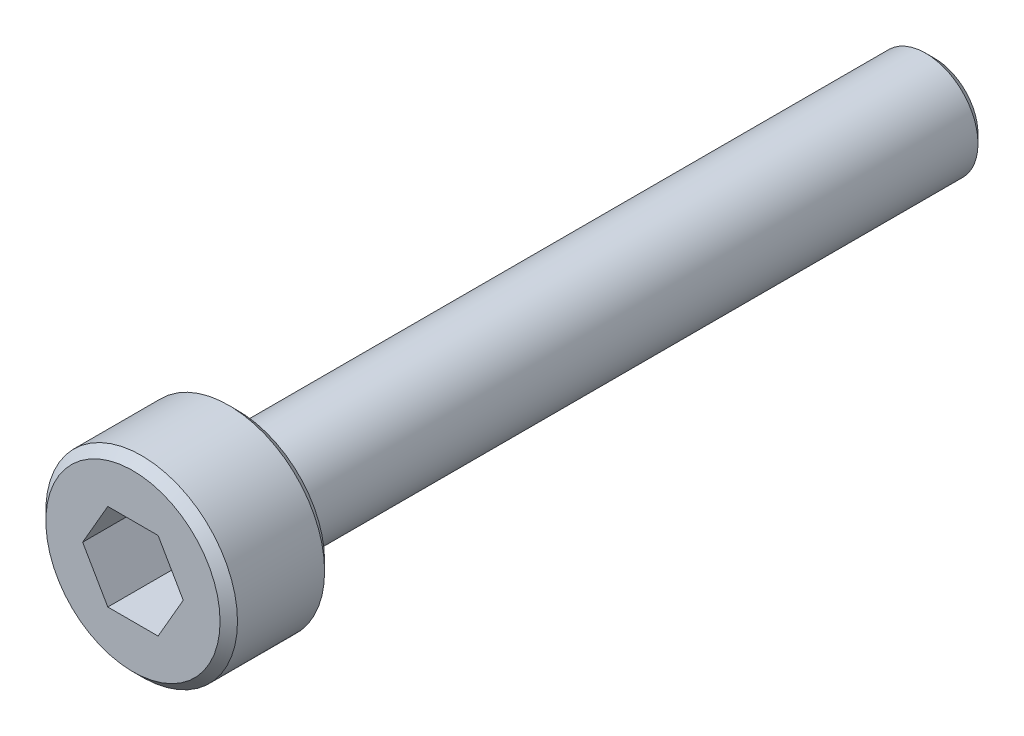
from build123d import *

# Parameters (mm, degrees)
SKETCH1_R           = 1.5
BOSS_EXTRUDE1_DEPTH = 20
SKETCH2_R           = 2.75
BOSS_EXTRUDE2_DEPTH = 3
CHAMFER1_SIZE       = 0.25
CUT_EXTRUDE1_DEPTH  = 2


with BuildPart() as part:
    # Sketch1 → Boss-Extrude1 (new body)
    with BuildSketch(Plane(origin=(0, 0, 0), x_dir=(0, 1, 0), z_dir=(0, 0, 1))):
        with Locations(Location((0, 0, 0), (0, 0, 270))):
            Circle(SKETCH1_R)
    extrude(amount=BOSS_EXTRUDE1_DEPTH)

    # Sketch2 → Boss-Extrude2 (add)
    with BuildSketch(Plane.XY.offset(20)):
        Circle(SKETCH2_R)
    extrude(amount=BOSS_EXTRUDE2_DEPTH)

    # Chamfer1
    chamfer1_edges = [part.edges().sort_by_distance(p)[0] for p in [
        (-1.5, 0, 0),
        (-2.75, 0, 20),
        (-2.75, 0, 23),
    ]]
    chamfer(chamfer1_edges, length=CHAMFER1_SIZE)

    # Sketch3 → Cut-Extrude1 (cut)
    with BuildSketch(Plane.XY.offset(23)):
        Polygon((1.443375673, 0), (0.721687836, 1.25), (-0.721687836, 1.25), (-1.443375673, 0), (-0.721687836, -1.25), (0.721687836, -1.25), align=None)
    extrude(amount=-CUT_EXTRUDE1_DEPTH, mode=Mode.SUBTRACT)


solid = part.part
